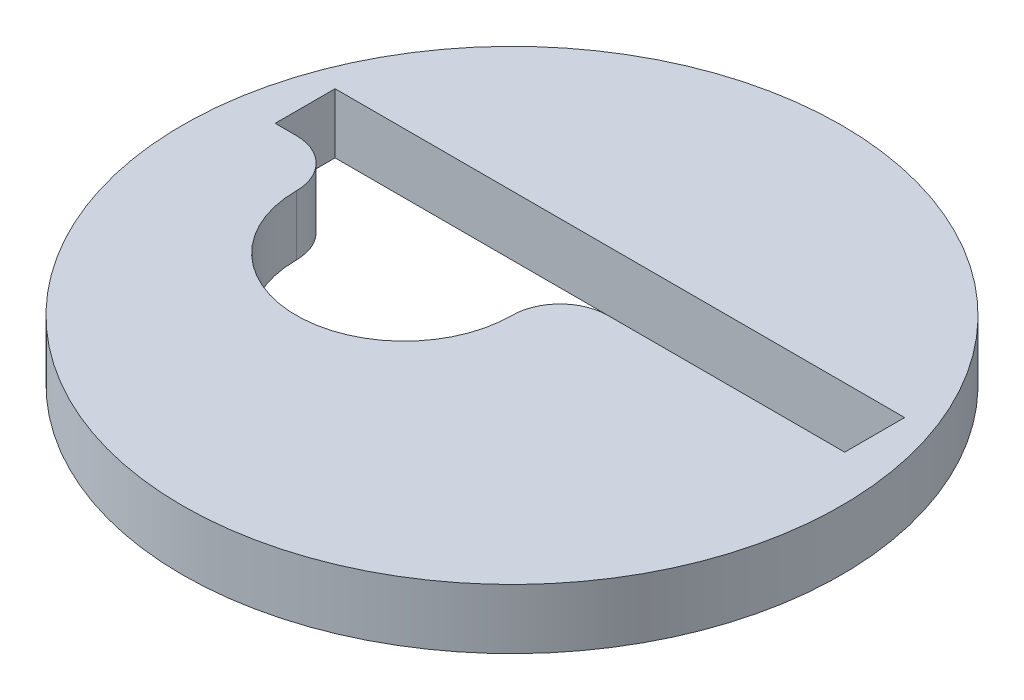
from build123d import *

# Parameters (mm, degrees)
SKETCH1_R           = 17.4625
BOSS_EXTRUDE1_DEPTH = 3.175
SKETCH2_W           = 30.17980714
SKETCH2_H           = 3.175
CUT_EXTRUDE1_DEPTH  = 25.898964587
SKETCH3_R           = 5.715
CUT_EXTRUDE2_DEPTH  = 25.898964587
FILLET1_R           = 2.54


with BuildPart() as part:
    # Sketch1 → Boss-Extrude1 (new body)
    with BuildSketch(Plane(origin=(0, 0, 0), x_dir=(1, 0, 0), z_dir=(0, 1, 0))):
        with Locations(Location((0, 0, 0), (0, 0, 270))):
            Circle(SKETCH1_R)
    extrude(amount=BOSS_EXTRUDE1_DEPTH)

    # Sketch2 → Cut-Extrude1 (cut, through all)
    with BuildSketch(Plane(origin=(0, 3.175, 0), x_dir=(1, 0, 0), z_dir=(0, 1, 0))):
        with Locations((0, 4.1275)):
            Rectangle(SKETCH2_W, SKETCH2_H)
    extrude(amount=-CUT_EXTRUDE1_DEPTH, mode=Mode.SUBTRACT)

    # Sketch3 → Cut-Extrude2 (cut, through all)
    with BuildSketch(Plane(origin=(0, 3.175, 0), x_dir=(1, 0, 0), z_dir=(0, 1, 0))):
        with Locations((-5.715, 0)):
            Circle(SKETCH3_R)
    extrude(amount=-CUT_EXTRUDE2_DEPTH, mode=Mode.SUBTRACT)

    # Fillet1
    fillet1_edges = [part.edges().sort_by_distance(p)[0] for p in [
        (-0.59546633, 1.5875, -2.54),
        (-10.83453367, 1.5875, -2.54),
    ]]
    fillet(fillet1_edges, radius=FILLET1_R)


solid = part.part
